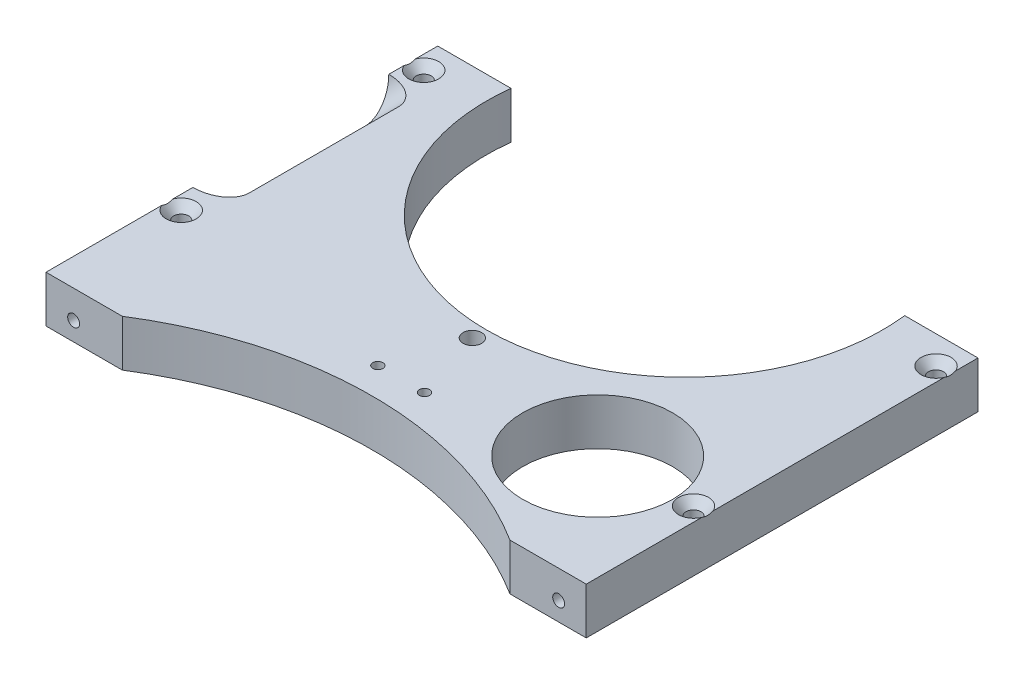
from build123d import *

# Parameters (mm, degrees)
EXTRUDE1_DEPTH                                     = 15.875
CSK_FOR_10_FLAT_HEAD_SOCKET_CAP_SCREW1_D           = 5.1054
CSK_FOR_10_FLAT_HEAD_SOCKET_CAP_SCREW1_CSINK_D     = 10.21334
CSK_FOR_10_FLAT_HEAD_SOCKET_CAP_SCREW1_CSINK_ANGLE = 82
SKETCH11_R                                         = 25.527
EXTRUDE9_DEPTH                                     = 185.141284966
F_10_32_TAPPED_HOLE1_D                             = 4.0386
F_10_32_TAPPED_HOLE1_DEPTH                         = 22.225
F_10_32_TAPPED_HOLE1_TIP                           = 1.213317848
CUT_EXTRUDE1_DEPTH                                 = 191.150617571
SKETCH19_R                                         = 3.175
CUT_EXTRUDE2_DEPTH                                 = 12.7
F_8_32_TAPPED_HOLE8_D                              = 3.4544


with BuildPart() as part:
    # Sketch1 → Extrude1 (new body)
    with BuildSketch(Plane(origin=(0, 50.0126, 0), x_dir=(-1, 0, 0), z_dir=(0, 1, 0))):
        with BuildLine():
            Line((65.981052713, -25.4), (91.948, -25.4))
            Line((91.948, -25.4), (91.948, -158.75))
            Line((91.948, -158.75), (66.993816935, -158.75))
            ThreePointArc((66.993816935, -158.75), (0, -83.3501), (-66.993816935, -158.75))
            Line((-66.993816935, -158.75), (-91.948, -158.75))
            Line((-91.948, -158.75), (-91.948, -25.4))
            Line((-91.948, -25.4), (-65.981052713, -25.4))
            ThreePointArc((-65.981052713, -25.4), (0, -44.44365), (65.981052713, -25.4))
        make_face()
    extrude(amount=-EXTRUDE1_DEPTH)

    # CSK for _10 Flat Head Socket Cap Screw1 (through all)
    with Locations(Plane(origin=(0, 50.0126, 0), x_dir=(-1, 0, 0), z_dir=(0, 1, 0))):
        with Locations((87.1982, -66.675), (87.1982, -149.225), (-87.1982, -66.675), (-87.1982, -149.225)):
            CounterSinkHole(CSK_FOR_10_FLAT_HEAD_SOCKET_CAP_SCREW1_D / 2, CSK_FOR_10_FLAT_HEAD_SOCKET_CAP_SCREW1_CSINK_D / 2, counter_sink_angle=CSK_FOR_10_FLAT_HEAD_SOCKET_CAP_SCREW1_CSINK_ANGLE)

    # Sketch11 → Extrude9 (cut, through all)
    with BuildSketch(Plane(origin=(0, 50.0126, 0), x_dir=(1, 0, 0), z_dir=(0, 1, 0))):
        with Locations(Location((56.134, 65.0875, 0), (0, 0, 270))):
            Circle(SKETCH11_R)
    extrude(amount=-EXTRUDE9_DEPTH, mode=Mode.SUBTRACT)

    # 10-32 Tapped Hole1
    with Locations(Plane.XY.offset(-25.4)):
        with Locations((82.55, 40.4876), (-82.55, 40.4876)):
            Hole(F_10_32_TAPPED_HOLE1_D / 2, depth=F_10_32_TAPPED_HOLE1_DEPTH)
            with Locations((0, 0, -(F_10_32_TAPPED_HOLE1_DEPTH + F_10_32_TAPPED_HOLE1_TIP / 2))):  # 118° drill point
                Cone(0, F_10_32_TAPPED_HOLE1_D / 2, F_10_32_TAPPED_HOLE1_TIP, mode=Mode.SUBTRACT)

    # Sketch16 → Cut-Extrude1 (cut, through all)
    with BuildSketch(Plane(origin=(0, 0, 0), x_dir=(-0.7071067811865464, 0.7071067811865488, 0), z_dir=(0.7071067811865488, 0.7071067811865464, 0))):
        with BuildLine():
            Line((92.443802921, -83.34375), (92.443802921, -134.14375))
            ThreePointArc((92.443802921, -134.14375), (94.768642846, -139.756410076), (100.381302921, -142.08125))
            Line((100.381302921, -142.08125), (100.381302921, -75.40625))
            ThreePointArc((100.381302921, -75.40625), (94.768642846, -77.731089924), (92.443802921, -83.34375))
        make_face()
    extrude(amount=-CUT_EXTRUDE1_DEPTH, mode=Mode.SUBTRACT)

    # Sketch17 → 10-32 Tapped Hole2 (revolve, cut)
    with BuildSketch(Plane(origin=(-76.2, 42.0751, -158.75), x_dir=(0, 1, 0), z_dir=(1, 0, 0))):
        Polygon((0, 0), (0, 14.827717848), (2.0193, 13.6144), (2.0193, 0), align=None)
    f_10_32_tapped_hole2 = revolve(axis=Axis((-76.2, 42.0751, -165.1), (0, 0, 1)), mode=Mode.SUBTRACT)

    # Mirror1: 10-32 Tapped Hole2 across plane
    add(f_10_32_tapped_hole2.mirror(Plane(origin=(0, 0, 0), x_dir=(0, 0, 1), z_dir=(1, 0, 0))), mode=Mode.SUBTRACT)

    # Sketch19 → Cut-Extrude2 (cut)
    with BuildSketch(Plane(origin=(0, 50.0126, 0), x_dir=(1, 0, 0), z_dir=(0, 1, 0))):
        with Locations(Location((0, 78.58125, 0), (0, 0, 270))):
            Circle(SKETCH19_R)
    extrude(amount=-CUT_EXTRUDE2_DEPTH, mode=Mode.SUBTRACT)

    # 8-32 Tapped Hole8 (through all)
    with Locations(Plane(origin=(0, 50.0126, 0), x_dir=(1, 0, 0), z_dir=(0, 1, 0))):
        with Locations((-7.9375, 54.356), (7.9375, 54.356)):
            Hole(F_8_32_TAPPED_HOLE8_D / 2)


solid = part.part
